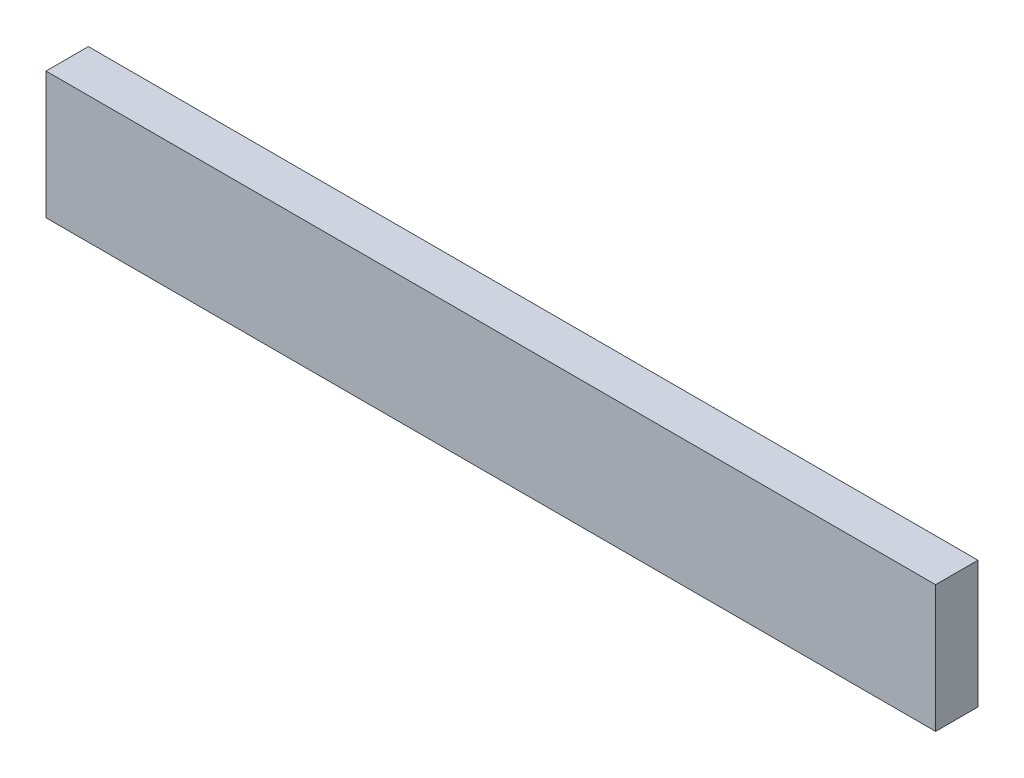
ISO-10303-21;
HEADER;
FILE_DESCRIPTION(('STEP AP214'),'2;1');
FILE_NAME('part.step','',(''),(''),'','','');
FILE_SCHEMA(('AUTOMOTIVE_DESIGN { 1 0 10303 214 1 1 1 1 }'));
ENDSEC;
DATA;
#1=APPLICATION_CONTEXT('core data for automotive mechanical design processes');
#2=APPLICATION_PROTOCOL_DEFINITION('international standard','automotive_design',2000,#1);
#3=PRODUCT_CONTEXT('',#1,'mechanical');
#4=PRODUCT('Part','Part','',(#3));
#5=PRODUCT_RELATED_PRODUCT_CATEGORY('part','',(#4));
#6=PRODUCT_DEFINITION_FORMATION('','',#4);
#7=PRODUCT_DEFINITION_CONTEXT('part definition',#1,'design');
#8=PRODUCT_DEFINITION('design','',#6,#7);
#9=PRODUCT_DEFINITION_SHAPE('','',#8);
#10=(LENGTH_UNIT() NAMED_UNIT(*) SI_UNIT(.MILLI.,.METRE.));
#11=(NAMED_UNIT(*) PLANE_ANGLE_UNIT() SI_UNIT($,.RADIAN.));
#12=(NAMED_UNIT(*) SI_UNIT($,.STERADIAN.) SOLID_ANGLE_UNIT());
#13=UNCERTAINTY_MEASURE_WITH_UNIT(LENGTH_MEASURE(1.E-05),#10,'distance_accuracy_value','');
#14=(GEOMETRIC_REPRESENTATION_CONTEXT(3) GLOBAL_UNCERTAINTY_ASSIGNED_CONTEXT((#13)) GLOBAL_UNIT_ASSIGNED_CONTEXT((#10,
#11,#12)) REPRESENTATION_CONTEXT('',''));
#15=CARTESIAN_POINT('',(0.,0.,0.));
#16=DIRECTION('',(0.,0.,1.));
#17=DIRECTION('',(1.,0.,0.));
#18=AXIS2_PLACEMENT_3D('',#15,#16,#17);
#19=CARTESIAN_POINT('',(31.5,-4.5,3.));
#20=DIRECTION('',(-1.,0.,0.));
#21=DIRECTION('',(0.,0.,1.));
#22=AXIS2_PLACEMENT_3D('',#19,#20,#21);
#23=PLANE('',#22);
#24=DIRECTION('',(0.,1.,0.));
#25=VECTOR('',#24,1.);
#26=CARTESIAN_POINT('',(31.5,-4.5,0.));
#27=LINE('',#26,#25);
#28=CARTESIAN_POINT('',(31.5,-4.5,0.));
#29=VERTEX_POINT('',#28);
#30=CARTESIAN_POINT('',(31.5,4.5,0.));
#31=VERTEX_POINT('',#30);
#32=EDGE_CURVE('E94',#29,#31,#27,.T.);
#33=ORIENTED_EDGE('',*,*,#32,.T.);
#34=DIRECTION('',(0.,0.,-1.));
#35=VECTOR('',#34,1.);
#36=CARTESIAN_POINT('',(31.5,4.5,3.));
#37=LINE('',#36,#35);
#38=CARTESIAN_POINT('',(31.5,4.5,3.));
#39=VERTEX_POINT('',#38);
#40=EDGE_CURVE('E11',#39,#31,#37,.T.);
#41=ORIENTED_EDGE('',*,*,#40,.F.);
#42=DIRECTION('',(0.,1.,0.));
#43=VECTOR('',#42,1.);
#44=CARTESIAN_POINT('',(31.5,-4.5,3.));
#45=LINE('',#44,#43);
#46=CARTESIAN_POINT('',(31.5,-4.5,3.));
#47=VERTEX_POINT('',#46);
#48=EDGE_CURVE('E82',#47,#39,#45,.T.);
#49=ORIENTED_EDGE('',*,*,#48,.F.);
#50=DIRECTION('',(0.,0.,-1.));
#51=VECTOR('',#50,1.);
#52=CARTESIAN_POINT('',(31.5,-4.5,3.));
#53=LINE('',#52,#51);
#54=EDGE_CURVE('E90',#47,#29,#53,.T.);
#55=ORIENTED_EDGE('',*,*,#54,.T.);
#56=EDGE_LOOP('',(#33,#41,#49,#55));
#57=FACE_BOUND('',#56,.T.);
#58=ADVANCED_FACE('F31',(#57),#23,.F.);
#59=CARTESIAN_POINT('',(-31.5,4.5,3.));
#60=DIRECTION('',(0.,-1.,0.));
#61=DIRECTION('',(0.,0.,-1.));
#62=AXIS2_PLACEMENT_3D('',#59,#60,#61);
#63=PLANE('',#62);
#64=DIRECTION('',(-1.,0.,0.));
#65=VECTOR('',#64,1.);
#66=CARTESIAN_POINT('',(-31.5,4.5,0.));
#67=LINE('',#66,#65);
#68=CARTESIAN_POINT('',(-31.5,4.5,0.));
#69=VERTEX_POINT('',#68);
#70=EDGE_CURVE('E86',#31,#69,#67,.T.);
#71=ORIENTED_EDGE('',*,*,#70,.T.);
#72=DIRECTION('',(0.,0.,-1.));
#73=VECTOR('',#72,1.);
#74=CARTESIAN_POINT('',(-31.5,4.5,3.));
#75=LINE('',#74,#73);
#76=CARTESIAN_POINT('',(-31.5,4.5,3.));
#77=VERTEX_POINT('',#76);
#78=EDGE_CURVE('E39',#77,#69,#75,.T.);
#79=ORIENTED_EDGE('',*,*,#78,.F.);
#80=DIRECTION('',(-1.,0.,0.));
#81=VECTOR('',#80,1.);
#82=CARTESIAN_POINT('',(-31.5,4.5,3.));
#83=LINE('',#82,#81);
#84=EDGE_CURVE('E77',#39,#77,#83,.T.);
#85=ORIENTED_EDGE('',*,*,#84,.F.);
#86=ORIENTED_EDGE('',*,*,#40,.T.);
#87=EDGE_LOOP('',(#71,#79,#85,#86));
#88=FACE_BOUND('',#87,.T.);
#89=ADVANCED_FACE('F85',(#88),#63,.F.);
#90=CARTESIAN_POINT('',(-31.5,-4.5,3.));
#91=DIRECTION('',(1.,0.,0.));
#92=DIRECTION('',(0.,0.,-1.));
#93=AXIS2_PLACEMENT_3D('',#90,#91,#92);
#94=PLANE('',#93);
#95=DIRECTION('',(0.,-1.,0.));
#96=VECTOR('',#95,1.);
#97=CARTESIAN_POINT('',(-31.5,-4.5,0.));
#98=LINE('',#97,#96);
#99=CARTESIAN_POINT('',(-31.5,-4.5,0.));
#100=VERTEX_POINT('',#99);
#101=EDGE_CURVE('E64',#69,#100,#98,.T.);
#102=ORIENTED_EDGE('',*,*,#101,.T.);
#103=DIRECTION('',(0.,0.,-1.));
#104=VECTOR('',#103,1.);
#105=CARTESIAN_POINT('',(-31.5,-4.5,3.));
#106=LINE('',#105,#104);
#107=CARTESIAN_POINT('',(-31.5,-4.5,3.));
#108=VERTEX_POINT('',#107);
#109=EDGE_CURVE('E87',#108,#100,#106,.T.);
#110=ORIENTED_EDGE('',*,*,#109,.F.);
#111=DIRECTION('',(0.,-1.,0.));
#112=VECTOR('',#111,1.);
#113=CARTESIAN_POINT('',(-31.5,-4.5,3.));
#114=LINE('',#113,#112);
#115=EDGE_CURVE('E80',#77,#108,#114,.T.);
#116=ORIENTED_EDGE('',*,*,#115,.F.);
#117=ORIENTED_EDGE('',*,*,#78,.T.);
#118=EDGE_LOOP('',(#102,#110,#116,#117));
#119=FACE_BOUND('',#118,.T.);
#120=ADVANCED_FACE('F88',(#119),#94,.F.);
#121=CARTESIAN_POINT('',(-31.5,-4.5,3.));
#122=DIRECTION('',(0.,1.,0.));
#123=DIRECTION('',(0.,0.,1.));
#124=AXIS2_PLACEMENT_3D('',#121,#122,#123);
#125=PLANE('',#124);
#126=DIRECTION('',(1.,0.,0.));
#127=VECTOR('',#126,1.);
#128=CARTESIAN_POINT('',(-31.5,-4.5,0.));
#129=LINE('',#128,#127);
#130=EDGE_CURVE('E70',#100,#29,#129,.T.);
#131=ORIENTED_EDGE('',*,*,#130,.T.);
#132=ORIENTED_EDGE('',*,*,#54,.F.);
#133=DIRECTION('',(1.,0.,0.));
#134=VECTOR('',#133,1.);
#135=CARTESIAN_POINT('',(-31.5,-4.5,3.));
#136=LINE('',#135,#134);
#137=EDGE_CURVE('E47',#108,#47,#136,.T.);
#138=ORIENTED_EDGE('',*,*,#137,.F.);
#139=ORIENTED_EDGE('',*,*,#109,.T.);
#140=EDGE_LOOP('',(#131,#132,#138,#139));
#141=FACE_BOUND('',#140,.T.);
#142=ADVANCED_FACE('F101',(#141),#125,.F.);
#143=CARTESIAN_POINT('',(31.5,4.5,3.));
#144=DIRECTION('',(0.,0.,-1.));
#145=DIRECTION('',(-1.,0.,0.));
#146=AXIS2_PLACEMENT_3D('',#143,#144,#145);
#147=PLANE('',#146);
#148=ORIENTED_EDGE('',*,*,#48,.T.);
#149=ORIENTED_EDGE('',*,*,#84,.T.);
#150=ORIENTED_EDGE('',*,*,#115,.T.);
#151=ORIENTED_EDGE('',*,*,#137,.T.);
#152=EDGE_LOOP('',(#148,#149,#150,#151));
#153=FACE_BOUND('',#152,.T.);
#154=ADVANCED_FACE('F78',(#153),#147,.F.);
#155=CARTESIAN_POINT('',(31.5,4.5,0.));
#156=DIRECTION('',(0.,0.,-1.));
#157=DIRECTION('',(-1.,0.,0.));
#158=AXIS2_PLACEMENT_3D('',#155,#156,#157);
#159=PLANE('',#158);
#160=ORIENTED_EDGE('',*,*,#32,.F.);
#161=ORIENTED_EDGE('',*,*,#130,.F.);
#162=ORIENTED_EDGE('',*,*,#101,.F.);
#163=ORIENTED_EDGE('',*,*,#70,.F.);
#164=EDGE_LOOP('',(#160,#161,#162,#163));
#165=FACE_BOUND('',#164,.T.);
#166=ADVANCED_FACE('F104',(#165),#159,.T.);
#167=CLOSED_SHELL('',(#58,#89,#120,#142,#154,#166));
#168=MANIFOLD_SOLID_BREP('B2',#167);
#169=ADVANCED_BREP_SHAPE_REPRESENTATION('',(#18,#168),#14);
#170=SHAPE_DEFINITION_REPRESENTATION(#9,#169);
ENDSEC;
END-ISO-10303-21;
